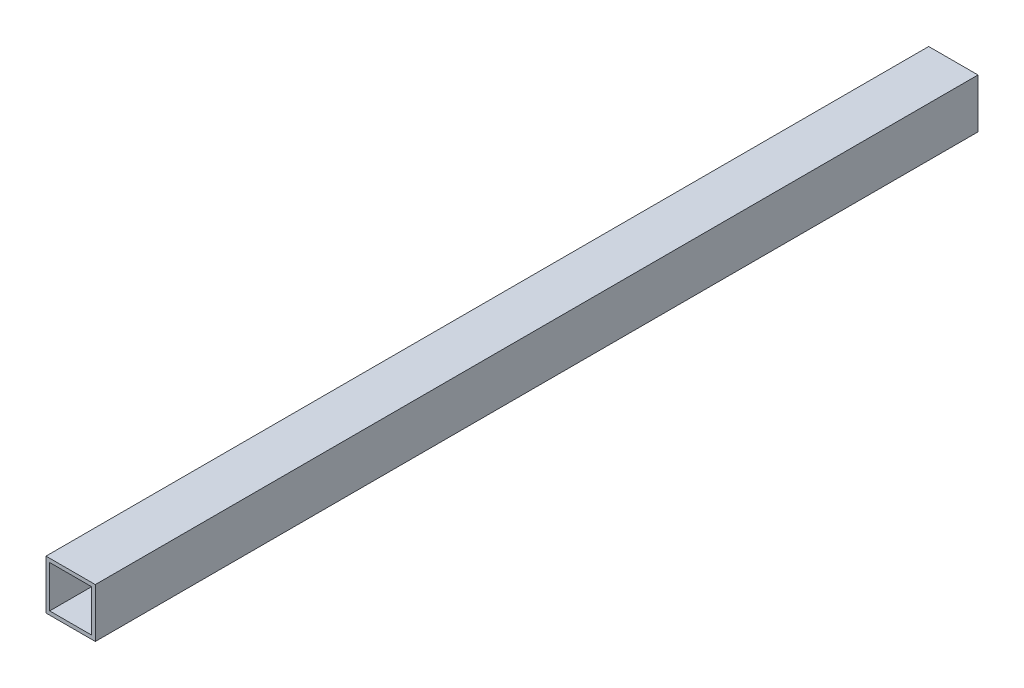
ISO-10303-21;
HEADER;
FILE_DESCRIPTION(('STEP AP214'),'2;1');
FILE_NAME('part.step','',(''),(''),'','','');
FILE_SCHEMA(('AUTOMOTIVE_DESIGN { 1 0 10303 214 1 1 1 1 }'));
ENDSEC;
DATA;
#1=APPLICATION_CONTEXT('core data for automotive mechanical design processes');
#2=APPLICATION_PROTOCOL_DEFINITION('international standard','automotive_design',2000,#1);
#3=PRODUCT_CONTEXT('',#1,'mechanical');
#4=PRODUCT('Part','Part','',(#3));
#5=PRODUCT_RELATED_PRODUCT_CATEGORY('part','',(#4));
#6=PRODUCT_DEFINITION_FORMATION('','',#4);
#7=PRODUCT_DEFINITION_CONTEXT('part definition',#1,'design');
#8=PRODUCT_DEFINITION('design','',#6,#7);
#9=PRODUCT_DEFINITION_SHAPE('','',#8);
#10=(LENGTH_UNIT() NAMED_UNIT(*) SI_UNIT(.MILLI.,.METRE.));
#11=(NAMED_UNIT(*) PLANE_ANGLE_UNIT() SI_UNIT($,.RADIAN.));
#12=(NAMED_UNIT(*) SI_UNIT($,.STERADIAN.) SOLID_ANGLE_UNIT());
#13=UNCERTAINTY_MEASURE_WITH_UNIT(LENGTH_MEASURE(1.E-05),#10,'distance_accuracy_value','');
#14=(GEOMETRIC_REPRESENTATION_CONTEXT(3) GLOBAL_UNCERTAINTY_ASSIGNED_CONTEXT((#13)) GLOBAL_UNIT_ASSIGNED_CONTEXT((#10,
#11,#12)) REPRESENTATION_CONTEXT('',''));
#15=CARTESIAN_POINT('',(0.,0.,0.));
#16=DIRECTION('',(0.,0.,1.));
#17=DIRECTION('',(1.,0.,0.));
#18=AXIS2_PLACEMENT_3D('',#15,#16,#17);
#19=CARTESIAN_POINT('',(-17.,17.,0.));
#20=DIRECTION('',(1.,0.,0.));
#21=DIRECTION('',(0.,1.,0.));
#22=AXIS2_PLACEMENT_3D('',#19,#20,#21);
#23=PLANE('',#22);
#24=DIRECTION('',(0.,-1.,0.));
#25=VECTOR('',#24,1.);
#26=CARTESIAN_POINT('',(-17.,-920.00000005,42.0000001));
#27=LINE('',#26,#25);
#28=CARTESIAN_POINT('',(-17.,17.,42.0000001));
#29=VERTEX_POINT('',#28);
#30=CARTESIAN_POINT('',(-17.,-17.,42.0000001));
#31=VERTEX_POINT('',#30);
#32=EDGE_CURVE('E140',#29,#31,#27,.T.);
#33=ORIENTED_EDGE('',*,*,#32,.F.);
#34=DIRECTION('',(0.,0.,1.));
#35=VECTOR('',#34,1.);
#36=CARTESIAN_POINT('',(-17.,17.,0.));
#37=LINE('',#36,#35);
#38=CARTESIAN_POINT('',(-17.,17.,757.9999999));
#39=VERTEX_POINT('',#38);
#40=EDGE_CURVE('E10',#29,#39,#37,.T.);
#41=ORIENTED_EDGE('',*,*,#40,.T.);
#42=DIRECTION('',(0.,-1.,0.));
#43=VECTOR('',#42,1.);
#44=CARTESIAN_POINT('',(-17.,-920.00000005,757.9999999));
#45=LINE('',#44,#43);
#46=CARTESIAN_POINT('',(-17.,-17.,757.9999999));
#47=VERTEX_POINT('',#46);
#48=EDGE_CURVE('E180',#39,#47,#45,.T.);
#49=ORIENTED_EDGE('',*,*,#48,.T.);
#50=DIRECTION('',(0.,0.,1.));
#51=VECTOR('',#50,1.);
#52=CARTESIAN_POINT('',(-17.,-17.,0.));
#53=LINE('',#52,#51);
#54=EDGE_CURVE('E155',#31,#47,#53,.T.);
#55=ORIENTED_EDGE('',*,*,#54,.F.);
#56=EDGE_LOOP('',(#33,#41,#49,#55));
#57=FACE_BOUND('',#56,.T.);
#58=ADVANCED_FACE('F16',(#57),#23,.T.);
#59=CARTESIAN_POINT('',(17.,17.,0.));
#60=DIRECTION('',(0.,-1.,0.));
#61=DIRECTION('',(0.,0.,-1.));
#62=AXIS2_PLACEMENT_3D('',#59,#60,#61);
#63=PLANE('',#62);
#64=DIRECTION('',(-1.,0.,0.));
#65=VECTOR('',#64,1.);
#66=CARTESIAN_POINT('',(20.50000005,17.,42.0000001));
#67=LINE('',#66,#65);
#68=CARTESIAN_POINT('',(17.,17.,42.0000001));
#69=VERTEX_POINT('',#68);
#70=EDGE_CURVE('E138',#69,#29,#67,.T.);
#71=ORIENTED_EDGE('',*,*,#70,.F.);
#72=DIRECTION('',(0.,0.,1.));
#73=VECTOR('',#72,1.);
#74=CARTESIAN_POINT('',(17.,17.,0.));
#75=LINE('',#74,#73);
#76=CARTESIAN_POINT('',(17.,17.,757.9999999));
#77=VERTEX_POINT('',#76);
#78=EDGE_CURVE('E19',#69,#77,#75,.T.);
#79=ORIENTED_EDGE('',*,*,#78,.T.);
#80=DIRECTION('',(-1.,0.,0.));
#81=VECTOR('',#80,1.);
#82=CARTESIAN_POINT('',(20.50000005,17.,757.9999999));
#83=LINE('',#82,#81);
#84=EDGE_CURVE('E183',#77,#39,#83,.T.);
#85=ORIENTED_EDGE('',*,*,#84,.T.);
#86=ORIENTED_EDGE('',*,*,#40,.F.);
#87=EDGE_LOOP('',(#71,#79,#85,#86));
#88=FACE_BOUND('',#87,.T.);
#89=ADVANCED_FACE('F264',(#88),#63,.T.);
#90=CARTESIAN_POINT('',(17.,-17.,0.));
#91=DIRECTION('',(-1.,0.,0.));
#92=DIRECTION('',(0.,0.,1.));
#93=AXIS2_PLACEMENT_3D('',#90,#91,#92);
#94=PLANE('',#93);
#95=DIRECTION('',(0.,1.,0.));
#96=VECTOR('',#95,1.);
#97=CARTESIAN_POINT('',(17.,-937.00000005,42.0000001));
#98=LINE('',#97,#96);
#99=CARTESIAN_POINT('',(17.,-17.,42.0000001));
#100=VERTEX_POINT('',#99);
#101=EDGE_CURVE('E141',#100,#69,#98,.T.);
#102=ORIENTED_EDGE('',*,*,#101,.F.);
#103=DIRECTION('',(0.,0.,1.));
#104=VECTOR('',#103,1.);
#105=CARTESIAN_POINT('',(17.,-17.,0.));
#106=LINE('',#105,#104);
#107=CARTESIAN_POINT('',(17.,-17.,757.9999999));
#108=VERTEX_POINT('',#107);
#109=EDGE_CURVE('E189',#100,#108,#106,.T.);
#110=ORIENTED_EDGE('',*,*,#109,.T.);
#111=DIRECTION('',(0.,1.,0.));
#112=VECTOR('',#111,1.);
#113=CARTESIAN_POINT('',(17.,-937.00000005,757.9999999));
#114=LINE('',#113,#112);
#115=EDGE_CURVE('E156',#108,#77,#114,.T.);
#116=ORIENTED_EDGE('',*,*,#115,.T.);
#117=ORIENTED_EDGE('',*,*,#78,.F.);
#118=EDGE_LOOP('',(#102,#110,#116,#117));
#119=FACE_BOUND('',#118,.T.);
#120=ADVANCED_FACE('F255',(#119),#94,.T.);
#121=CARTESIAN_POINT('',(-17.,-17.,0.));
#122=DIRECTION('',(0.,1.,0.));
#123=DIRECTION('',(1.,0.,0.));
#124=AXIS2_PLACEMENT_3D('',#121,#122,#123);
#125=PLANE('',#124);
#126=DIRECTION('',(1.,0.,0.));
#127=VECTOR('',#126,1.);
#128=CARTESIAN_POINT('',(3.50000005,-17.,42.0000001));
#129=LINE('',#128,#127);
#130=EDGE_CURVE('E147',#31,#100,#129,.T.);
#131=ORIENTED_EDGE('',*,*,#130,.F.);
#132=ORIENTED_EDGE('',*,*,#54,.T.);
#133=DIRECTION('',(1.,0.,0.));
#134=VECTOR('',#133,1.);
#135=CARTESIAN_POINT('',(3.50000005,-17.,757.9999999));
#136=LINE('',#135,#134);
#137=EDGE_CURVE('E168',#47,#108,#136,.T.);
#138=ORIENTED_EDGE('',*,*,#137,.T.);
#139=ORIENTED_EDGE('',*,*,#109,.F.);
#140=EDGE_LOOP('',(#131,#132,#138,#139));
#141=FACE_BOUND('',#140,.T.);
#142=ADVANCED_FACE('F246',(#141),#125,.T.);
#143=CARTESIAN_POINT('',(20.,20.,0.));
#144=DIRECTION('',(0.,-1.,0.));
#145=DIRECTION('',(0.,0.,-1.));
#146=AXIS2_PLACEMENT_3D('',#143,#144,#145);
#147=PLANE('',#146);
#148=DIRECTION('',(0.,0.,1.));
#149=VECTOR('',#148,1.);
#150=CARTESIAN_POINT('',(-20.,20.,0.));
#151=LINE('',#150,#149);
#152=CARTESIAN_POINT('',(-20.,20.,42.0000001));
#153=VERTEX_POINT('',#152);
#154=CARTESIAN_POINT('',(-20.,20.,757.9999999));
#155=VERTEX_POINT('',#154);
#156=EDGE_CURVE('E152',#153,#155,#151,.T.);
#157=ORIENTED_EDGE('',*,*,#156,.T.);
#158=DIRECTION('',(-1.,0.,0.));
#159=VECTOR('',#158,1.);
#160=CARTESIAN_POINT('',(22.00000005,20.,757.9999999));
#161=LINE('',#160,#159);
#162=CARTESIAN_POINT('',(20.,20.,757.9999999));
#163=VERTEX_POINT('',#162);
#164=EDGE_CURVE('E165',#163,#155,#161,.T.);
#165=ORIENTED_EDGE('',*,*,#164,.F.);
#166=DIRECTION('',(0.,0.,1.));
#167=VECTOR('',#166,1.);
#168=CARTESIAN_POINT('',(20.,20.,0.));
#169=LINE('',#168,#167);
#170=CARTESIAN_POINT('',(20.,20.,42.0000001));
#171=VERTEX_POINT('',#170);
#172=EDGE_CURVE('E150',#171,#163,#169,.T.);
#173=ORIENTED_EDGE('',*,*,#172,.F.);
#174=DIRECTION('',(-1.,0.,0.));
#175=VECTOR('',#174,1.);
#176=CARTESIAN_POINT('',(22.00000005,20.,42.0000001));
#177=LINE('',#176,#175);
#178=EDGE_CURVE('E110',#171,#153,#177,.T.);
#179=ORIENTED_EDGE('',*,*,#178,.T.);
#180=EDGE_LOOP('',(#157,#165,#173,#179));
#181=FACE_BOUND('',#180,.T.);
#182=ADVANCED_FACE('F231',(#181),#147,.F.);
#183=CARTESIAN_POINT('',(-20.,20.,0.));
#184=DIRECTION('',(1.,0.,0.));
#185=DIRECTION('',(0.,1.,0.));
#186=AXIS2_PLACEMENT_3D('',#183,#184,#185);
#187=PLANE('',#186);
#188=DIRECTION('',(0.,0.,1.));
#189=VECTOR('',#188,1.);
#190=CARTESIAN_POINT('',(-20.,-20.,0.));
#191=LINE('',#190,#189);
#192=CARTESIAN_POINT('',(-20.,-20.,42.0000001));
#193=VERTEX_POINT('',#192);
#194=CARTESIAN_POINT('',(-20.,-20.,757.9999999));
#195=VERTEX_POINT('',#194);
#196=EDGE_CURVE('E123',#193,#195,#191,.T.);
#197=ORIENTED_EDGE('',*,*,#196,.T.);
#198=DIRECTION('',(0.,-1.,0.));
#199=VECTOR('',#198,1.);
#200=CARTESIAN_POINT('',(-20.,-918.50000005,757.9999999));
#201=LINE('',#200,#199);
#202=EDGE_CURVE('E159',#155,#195,#201,.T.);
#203=ORIENTED_EDGE('',*,*,#202,.F.);
#204=ORIENTED_EDGE('',*,*,#156,.F.);
#205=DIRECTION('',(0.,-1.,0.));
#206=VECTOR('',#205,1.);
#207=CARTESIAN_POINT('',(-20.,-918.50000005,42.0000001));
#208=LINE('',#207,#206);
#209=EDGE_CURVE('E115',#153,#193,#208,.T.);
#210=ORIENTED_EDGE('',*,*,#209,.T.);
#211=EDGE_LOOP('',(#197,#203,#204,#210));
#212=FACE_BOUND('',#211,.T.);
#213=ADVANCED_FACE('F214',(#212),#187,.F.);
#214=CARTESIAN_POINT('',(24.0000001,-1857.0000001,757.9999999));
#215=DIRECTION('',(0.,0.,1.));
#216=DIRECTION('',(1.,0.,0.));
#217=AXIS2_PLACEMENT_3D('',#214,#215,#216);
#218=PLANE('',#217);
#219=ORIENTED_EDGE('',*,*,#137,.F.);
#220=ORIENTED_EDGE('',*,*,#48,.F.);
#221=ORIENTED_EDGE('',*,*,#84,.F.);
#222=ORIENTED_EDGE('',*,*,#115,.F.);
#223=EDGE_LOOP('',(#219,#220,#221,#222));
#224=FACE_BOUND('',#223,.T.);
#225=ORIENTED_EDGE('',*,*,#202,.T.);
#226=DIRECTION('',(1.,0.,0.));
#227=VECTOR('',#226,1.);
#228=CARTESIAN_POINT('',(2.00000005,-20.,757.9999999));
#229=LINE('',#228,#227);
#230=CARTESIAN_POINT('',(20.,-20.,757.9999999));
#231=VERTEX_POINT('',#230);
#232=EDGE_CURVE('E131',#195,#231,#229,.T.);
#233=ORIENTED_EDGE('',*,*,#232,.T.);
#234=DIRECTION('',(0.,1.,0.));
#235=VECTOR('',#234,1.);
#236=CARTESIAN_POINT('',(20.,-938.50000005,757.9999999));
#237=LINE('',#236,#235);
#238=EDGE_CURVE('E128',#231,#163,#237,.T.);
#239=ORIENTED_EDGE('',*,*,#238,.T.);
#240=ORIENTED_EDGE('',*,*,#164,.T.);
#241=EDGE_LOOP('',(#225,#233,#239,#240));
#242=FACE_BOUND('',#241,.T.);
#243=ADVANCED_FACE('F209',(#224,#242),#218,.T.);
#244=CARTESIAN_POINT('',(20.,-20.,0.));
#245=DIRECTION('',(-1.,0.,0.));
#246=DIRECTION('',(0.,0.,1.));
#247=AXIS2_PLACEMENT_3D('',#244,#245,#246);
#248=PLANE('',#247);
#249=ORIENTED_EDGE('',*,*,#172,.T.);
#250=ORIENTED_EDGE('',*,*,#238,.F.);
#251=DIRECTION('',(0.,0.,1.));
#252=VECTOR('',#251,1.);
#253=CARTESIAN_POINT('',(20.,-20.,0.));
#254=LINE('',#253,#252);
#255=CARTESIAN_POINT('',(20.,-20.,42.0000001));
#256=VERTEX_POINT('',#255);
#257=EDGE_CURVE('E121',#256,#231,#254,.T.);
#258=ORIENTED_EDGE('',*,*,#257,.F.);
#259=DIRECTION('',(0.,1.,0.));
#260=VECTOR('',#259,1.);
#261=CARTESIAN_POINT('',(20.,-938.50000005,42.0000001));
#262=LINE('',#261,#260);
#263=EDGE_CURVE('E103',#256,#171,#262,.T.);
#264=ORIENTED_EDGE('',*,*,#263,.T.);
#265=EDGE_LOOP('',(#249,#250,#258,#264));
#266=FACE_BOUND('',#265,.T.);
#267=ADVANCED_FACE('F126',(#266),#248,.F.);
#268=CARTESIAN_POINT('',(24.0000001,-1857.0000001,42.0000001));
#269=DIRECTION('',(0.,0.,1.));
#270=DIRECTION('',(1.,0.,0.));
#271=AXIS2_PLACEMENT_3D('',#268,#269,#270);
#272=PLANE('',#271);
#273=ORIENTED_EDGE('',*,*,#101,.T.);
#274=ORIENTED_EDGE('',*,*,#70,.T.);
#275=ORIENTED_EDGE('',*,*,#32,.T.);
#276=ORIENTED_EDGE('',*,*,#130,.T.);
#277=EDGE_LOOP('',(#273,#274,#275,#276));
#278=FACE_BOUND('',#277,.T.);
#279=ORIENTED_EDGE('',*,*,#178,.F.);
#280=ORIENTED_EDGE('',*,*,#263,.F.);
#281=DIRECTION('',(1.,0.,0.));
#282=VECTOR('',#281,1.);
#283=CARTESIAN_POINT('',(2.00000005,-20.,42.0000001));
#284=LINE('',#283,#282);
#285=EDGE_CURVE('E107',#193,#256,#284,.T.);
#286=ORIENTED_EDGE('',*,*,#285,.F.);
#287=ORIENTED_EDGE('',*,*,#209,.F.);
#288=EDGE_LOOP('',(#279,#280,#286,#287));
#289=FACE_BOUND('',#288,.T.);
#290=ADVANCED_FACE('F105',(#278,#289),#272,.F.);
#291=CARTESIAN_POINT('',(-20.,-20.,0.));
#292=DIRECTION('',(0.,1.,0.));
#293=DIRECTION('',(1.,0.,0.));
#294=AXIS2_PLACEMENT_3D('',#291,#292,#293);
#295=PLANE('',#294);
#296=ORIENTED_EDGE('',*,*,#257,.T.);
#297=ORIENTED_EDGE('',*,*,#232,.F.);
#298=ORIENTED_EDGE('',*,*,#196,.F.);
#299=ORIENTED_EDGE('',*,*,#285,.T.);
#300=EDGE_LOOP('',(#296,#297,#298,#299));
#301=FACE_BOUND('',#300,.T.);
#302=ADVANCED_FACE('F119',(#301),#295,.F.);
#303=CLOSED_SHELL('',(#58,#89,#120,#142,#182,#213,#243,#267,#290,#302));
#304=MANIFOLD_SOLID_BREP('B1',#303);
#305=ADVANCED_BREP_SHAPE_REPRESENTATION('',(#18,#304),#14);
#306=SHAPE_DEFINITION_REPRESENTATION(#9,#305);
ENDSEC;
END-ISO-10303-21;
